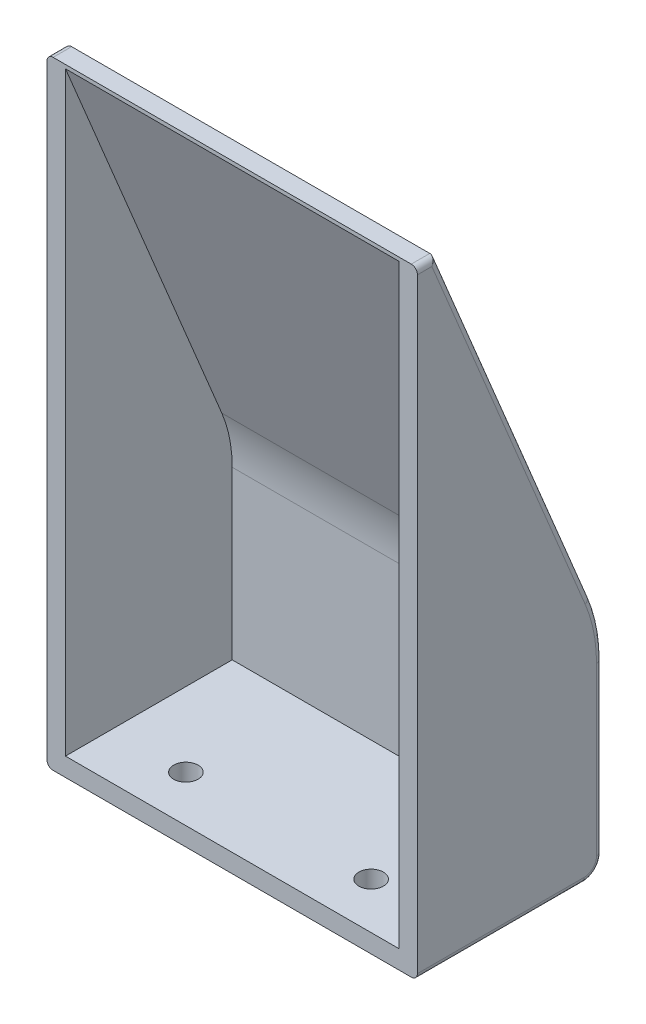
ISO-10303-21;
HEADER;
FILE_DESCRIPTION(('STEP AP214'),'2;1');
FILE_NAME('part.step','',(''),(''),'','','');
FILE_SCHEMA(('AUTOMOTIVE_DESIGN { 1 0 10303 214 1 1 1 1 }'));
ENDSEC;
DATA;
#1=APPLICATION_CONTEXT('core data for automotive mechanical design processes');
#2=APPLICATION_PROTOCOL_DEFINITION('international standard','automotive_design',2000,#1);
#3=PRODUCT_CONTEXT('',#1,'mechanical');
#4=PRODUCT('Part','Part','',(#3));
#5=PRODUCT_RELATED_PRODUCT_CATEGORY('part','',(#4));
#6=PRODUCT_DEFINITION_FORMATION('','',#4);
#7=PRODUCT_DEFINITION_CONTEXT('part definition',#1,'design');
#8=PRODUCT_DEFINITION('design','',#6,#7);
#9=PRODUCT_DEFINITION_SHAPE('','',#8);
#10=(LENGTH_UNIT() NAMED_UNIT(*) SI_UNIT(.MILLI.,.METRE.));
#11=(NAMED_UNIT(*) PLANE_ANGLE_UNIT() SI_UNIT($,.RADIAN.));
#12=(NAMED_UNIT(*) SI_UNIT($,.STERADIAN.) SOLID_ANGLE_UNIT());
#13=UNCERTAINTY_MEASURE_WITH_UNIT(LENGTH_MEASURE(1.E-05),#10,'distance_accuracy_value','');
#14=(GEOMETRIC_REPRESENTATION_CONTEXT(3) GLOBAL_UNCERTAINTY_ASSIGNED_CONTEXT((#13)) GLOBAL_UNIT_ASSIGNED_CONTEXT((#10,
#11,#12)) REPRESENTATION_CONTEXT('',''));
#15=CARTESIAN_POINT('',(0.,0.,0.));
#16=DIRECTION('',(0.,0.,1.));
#17=DIRECTION('',(1.,0.,0.));
#18=AXIS2_PLACEMENT_3D('',#15,#16,#17);
#19=CARTESIAN_POINT('',(-60.,200.,30.));
#20=DIRECTION('',(1.,0.,0.));
#21=DIRECTION('',(0.,0.,-1.));
#22=AXIS2_PLACEMENT_3D('',#19,#20,#21);
#23=PLANE('',#22);
#24=DIRECTION('',(0.,-1.,0.));
#25=VECTOR('',#24,1.);
#26=CARTESIAN_POINT('',(-60.,200.,30.));
#27=LINE('',#26,#25);
#28=CARTESIAN_POINT('',(-60.,198.,30.));
#29=VERTEX_POINT('',#28);
#30=CARTESIAN_POINT('',(-60.,2.,30.));
#31=VERTEX_POINT('',#30);
#32=EDGE_CURVE('E218',#29,#31,#27,.T.);
#33=ORIENTED_EDGE('',*,*,#32,.F.);
#34=DIRECTION('',(0.,0.,1.));
#35=VECTOR('',#34,1.);
#36=CARTESIAN_POINT('',(-60.,198.,24.));
#37=LINE('',#36,#35);
#38=CARTESIAN_POINT('',(-60.,198.,25.3349125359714));
#39=VERTEX_POINT('',#38);
#40=EDGE_CURVE('E272',#29,#39,#37,.F.);
#41=ORIENTED_EDGE('',*,*,#40,.T.);
#42=DIRECTION('',(0.,0.923496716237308,0.383606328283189));
#43=VECTOR('',#42,1.);
#44=CARTESIAN_POINT('',(-60.,201.358342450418,26.7299163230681));
#45=LINE('',#44,#43);
#46=CARTESIAN_POINT('',(-60.,78.4415159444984,-24.3278423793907));
#47=VERTEX_POINT('',#46);
#48=EDGE_CURVE('E270',#39,#47,#45,.F.);
#49=ORIENTED_EDGE('',*,*,#48,.T.);
#50=CARTESIAN_POINT('',(-60.,60.0284121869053,20.));
#51=DIRECTION('',(1.,0.,0.));
#52=DIRECTION('',(0.,0.,-1.));
#53=AXIS2_PLACEMENT_3D('',#50,#51,#52);
#54=CIRCLE('',#53,48.);
#55=CARTESIAN_POINT('',(-60.,60.0284121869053,-28.));
#56=VERTEX_POINT('',#55);
#57=EDGE_CURVE('E268',#47,#56,#54,.F.);
#58=ORIENTED_EDGE('',*,*,#57,.T.);
#59=DIRECTION('',(0.,-1.,0.));
#60=VECTOR('',#59,1.);
#61=CARTESIAN_POINT('',(-60.,200.,-28.));
#62=LINE('',#61,#60);
#63=CARTESIAN_POINT('',(-60.,6.00000000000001,-28.));
#64=VERTEX_POINT('',#63);
#65=EDGE_CURVE('E266',#56,#64,#62,.T.);
#66=ORIENTED_EDGE('',*,*,#65,.T.);
#67=CARTESIAN_POINT('',(-60.,6.00000000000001,-24.));
#68=DIRECTION('',(1.,0.,0.));
#69=DIRECTION('',(0.,0.,-1.));
#70=AXIS2_PLACEMENT_3D('',#67,#68,#69);
#71=CIRCLE('',#70,4.);
#72=CARTESIAN_POINT('',(-60.,2.,-24.));
#73=VERTEX_POINT('',#72);
#74=EDGE_CURVE('E264',#64,#73,#71,.F.);
#75=ORIENTED_EDGE('',*,*,#74,.T.);
#76=DIRECTION('',(0.,0.,1.));
#77=VECTOR('',#76,1.);
#78=CARTESIAN_POINT('',(-60.,2.,30.));
#79=LINE('',#78,#77);
#80=EDGE_CURVE('E262',#73,#31,#79,.T.);
#81=ORIENTED_EDGE('',*,*,#80,.T.);
#82=EDGE_LOOP('',(#33,#41,#49,#58,#66,#75,#81));
#83=FACE_BOUND('',#82,.T.);
#84=ADVANCED_FACE('F34',(#83),#23,.F.);
#85=CARTESIAN_POINT('',(60.,200.,30.));
#86=DIRECTION('',(0.,0.,-1.));
#87=DIRECTION('',(-1.,0.,0.));
#88=AXIS2_PLACEMENT_3D('',#85,#86,#87);
#89=PLANE('',#88);
#90=DIRECTION('',(-1.,0.,0.));
#91=VECTOR('',#90,1.);
#92=CARTESIAN_POINT('',(60.,198.803409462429,30.));
#93=LINE('',#92,#91);
#94=CARTESIAN_POINT('',(54.,198.803409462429,30.));
#95=VERTEX_POINT('',#94);
#96=CARTESIAN_POINT('',(-54.,198.803409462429,30.));
#97=VERTEX_POINT('',#96);
#98=EDGE_CURVE('E175',#95,#97,#93,.T.);
#99=ORIENTED_EDGE('',*,*,#98,.F.);
#100=DIRECTION('',(0.,-1.,0.));
#101=VECTOR('',#100,1.);
#102=CARTESIAN_POINT('',(54.,200.,30.));
#103=LINE('',#102,#101);
#104=CARTESIAN_POINT('',(54.,6.,30.));
#105=VERTEX_POINT('',#104);
#106=EDGE_CURVE('E193',#95,#105,#103,.T.);
#107=ORIENTED_EDGE('',*,*,#106,.T.);
#108=DIRECTION('',(1.,0.,0.));
#109=VECTOR('',#108,1.);
#110=CARTESIAN_POINT('',(60.,6.00000000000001,30.));
#111=LINE('',#110,#109);
#112=CARTESIAN_POINT('',(-54.,6.,30.));
#113=VERTEX_POINT('',#112);
#114=EDGE_CURVE('E198',#113,#105,#111,.T.);
#115=ORIENTED_EDGE('',*,*,#114,.F.);
#116=DIRECTION('',(0.,-1.,0.));
#117=VECTOR('',#116,1.);
#118=CARTESIAN_POINT('',(-54.,200.,30.));
#119=LINE('',#118,#117);
#120=EDGE_CURVE('E51',#97,#113,#119,.T.);
#121=ORIENTED_EDGE('',*,*,#120,.F.);
#122=EDGE_LOOP('',(#99,#107,#115,#121));
#123=FACE_BOUND('',#122,.T.);
#124=DIRECTION('',(0.,-1.,0.));
#125=VECTOR('',#124,1.);
#126=CARTESIAN_POINT('',(60.,200.,30.));
#127=LINE('',#126,#125);
#128=CARTESIAN_POINT('',(60.,198.,30.));
#129=VERTEX_POINT('',#128);
#130=CARTESIAN_POINT('',(60.,2.,30.));
#131=VERTEX_POINT('',#130);
#132=EDGE_CURVE('E214',#129,#131,#127,.T.);
#133=ORIENTED_EDGE('',*,*,#132,.F.);
#134=CARTESIAN_POINT('',(58.,198.,30.));
#135=DIRECTION('',(0.,0.,-1.));
#136=DIRECTION('',(-1.,0.,0.));
#137=AXIS2_PLACEMENT_3D('',#134,#135,#136);
#138=CIRCLE('',#137,2.);
#139=CARTESIAN_POINT('',(58.,200.,30.));
#140=VERTEX_POINT('',#139);
#141=EDGE_CURVE('E284',#129,#140,#138,.F.);
#142=ORIENTED_EDGE('',*,*,#141,.T.);
#143=DIRECTION('',(1.,0.,0.));
#144=VECTOR('',#143,1.);
#145=CARTESIAN_POINT('',(60.,200.,30.));
#146=LINE('',#145,#144);
#147=CARTESIAN_POINT('',(-58.,200.,30.));
#148=VERTEX_POINT('',#147);
#149=EDGE_CURVE('E211',#148,#140,#146,.T.);
#150=ORIENTED_EDGE('',*,*,#149,.F.);
#151=CARTESIAN_POINT('',(-58.,198.,30.));
#152=DIRECTION('',(0.,0.,-1.));
#153=DIRECTION('',(-1.,0.,0.));
#154=AXIS2_PLACEMENT_3D('',#151,#152,#153);
#155=CIRCLE('',#154,2.);
#156=EDGE_CURVE('E282',#148,#29,#155,.F.);
#157=ORIENTED_EDGE('',*,*,#156,.T.);
#158=ORIENTED_EDGE('',*,*,#32,.T.);
#159=CARTESIAN_POINT('',(-58.,2.,30.));
#160=DIRECTION('',(0.,0.,-1.));
#161=DIRECTION('',(-1.,0.,0.));
#162=AXIS2_PLACEMENT_3D('',#159,#160,#161);
#163=CIRCLE('',#162,2.);
#164=CARTESIAN_POINT('',(-58.,0.,30.));
#165=VERTEX_POINT('',#164);
#166=EDGE_CURVE('E278',#31,#165,#163,.F.);
#167=ORIENTED_EDGE('',*,*,#166,.T.);
#168=DIRECTION('',(1.,0.,0.));
#169=VECTOR('',#168,1.);
#170=CARTESIAN_POINT('',(60.,0.,30.));
#171=LINE('',#170,#169);
#172=CARTESIAN_POINT('',(58.,0.,30.));
#173=VERTEX_POINT('',#172);
#174=EDGE_CURVE('E209',#165,#173,#171,.T.);
#175=ORIENTED_EDGE('',*,*,#174,.T.);
#176=CARTESIAN_POINT('',(58.,2.,30.));
#177=DIRECTION('',(0.,0.,-1.));
#178=DIRECTION('',(-1.,0.,0.));
#179=AXIS2_PLACEMENT_3D('',#176,#177,#178);
#180=CIRCLE('',#179,2.);
#181=EDGE_CURVE('E280',#173,#131,#180,.F.);
#182=ORIENTED_EDGE('',*,*,#181,.T.);
#183=EDGE_LOOP('',(#133,#142,#150,#157,#158,#167,#175,#182));
#184=FACE_BOUND('',#183,.T.);
#185=ADVANCED_FACE('F327',(#123,#184),#89,.F.);
#186=CARTESIAN_POINT('',(60.,200.,30.));
#187=DIRECTION('',(-1.,0.,0.));
#188=DIRECTION('',(0.,0.,1.));
#189=AXIS2_PLACEMENT_3D('',#186,#187,#188);
#190=PLANE('',#189);
#191=DIRECTION('',(0.,0.923496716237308,0.383606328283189));
#192=VECTOR('',#191,1.);
#193=CARTESIAN_POINT('',(60.,201.358342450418,26.7299163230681));
#194=LINE('',#193,#192);
#195=CARTESIAN_POINT('',(60.,78.4415159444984,-24.3278423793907));
#196=VERTEX_POINT('',#195);
#197=CARTESIAN_POINT('',(60.,198.,25.3349125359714));
#198=VERTEX_POINT('',#197);
#199=EDGE_CURVE('E240',#196,#198,#194,.T.);
#200=ORIENTED_EDGE('',*,*,#199,.T.);
#201=DIRECTION('',(0.,0.,-1.));
#202=VECTOR('',#201,1.);
#203=CARTESIAN_POINT('',(60.,198.,30.));
#204=LINE('',#203,#202);
#205=EDGE_CURVE('E243',#198,#129,#204,.F.);
#206=ORIENTED_EDGE('',*,*,#205,.T.);
#207=ORIENTED_EDGE('',*,*,#132,.T.);
#208=DIRECTION('',(0.,0.,-1.));
#209=VECTOR('',#208,1.);
#210=CARTESIAN_POINT('',(60.,2.,30.));
#211=LINE('',#210,#209);
#212=CARTESIAN_POINT('',(60.,2.,-24.));
#213=VERTEX_POINT('',#212);
#214=EDGE_CURVE('E232',#131,#213,#211,.T.);
#215=ORIENTED_EDGE('',*,*,#214,.T.);
#216=CARTESIAN_POINT('',(60.,6.00000000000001,-24.));
#217=DIRECTION('',(-1.,0.,0.));
#218=DIRECTION('',(0.,0.,1.));
#219=AXIS2_PLACEMENT_3D('',#216,#217,#218);
#220=CIRCLE('',#219,4.);
#221=CARTESIAN_POINT('',(60.,6.00000000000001,-28.));
#222=VERTEX_POINT('',#221);
#223=EDGE_CURVE('E234',#213,#222,#220,.F.);
#224=ORIENTED_EDGE('',*,*,#223,.T.);
#225=DIRECTION('',(0.,-1.,0.));
#226=VECTOR('',#225,1.);
#227=CARTESIAN_POINT('',(60.,200.,-28.));
#228=LINE('',#227,#226);
#229=CARTESIAN_POINT('',(60.,60.0284121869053,-28.));
#230=VERTEX_POINT('',#229);
#231=EDGE_CURVE('E236',#222,#230,#228,.F.);
#232=ORIENTED_EDGE('',*,*,#231,.T.);
#233=CARTESIAN_POINT('',(60.,60.0284121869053,20.));
#234=DIRECTION('',(-1.,0.,0.));
#235=DIRECTION('',(0.,0.,1.));
#236=AXIS2_PLACEMENT_3D('',#233,#234,#235);
#237=CIRCLE('',#236,48.);
#238=EDGE_CURVE('E238',#230,#196,#237,.F.);
#239=ORIENTED_EDGE('',*,*,#238,.T.);
#240=EDGE_LOOP('',(#200,#206,#207,#215,#224,#232,#239));
#241=FACE_BOUND('',#240,.T.);
#242=ADVANCED_FACE('F366',(#241),#190,.F.);
#243=CARTESIAN_POINT('',(60.,200.,-30.));
#244=DIRECTION('',(0.,0.,1.));
#245=DIRECTION('',(1.,0.,0.));
#246=AXIS2_PLACEMENT_3D('',#243,#244,#245);
#247=PLANE('',#246);
#248=DIRECTION('',(-1.,0.,0.));
#249=VECTOR('',#248,1.);
#250=CARTESIAN_POINT('',(60.,60.0284121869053,-30.));
#251=LINE('',#250,#249);
#252=CARTESIAN_POINT('',(-58.,60.0284121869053,-30.));
#253=VERTEX_POINT('',#252);
#254=CARTESIAN_POINT('',(58.,60.0284121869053,-30.));
#255=VERTEX_POINT('',#254);
#256=EDGE_CURVE('E224',#253,#255,#251,.F.);
#257=ORIENTED_EDGE('',*,*,#256,.T.);
#258=DIRECTION('',(0.,-1.,0.));
#259=VECTOR('',#258,1.);
#260=CARTESIAN_POINT('',(58.,200.,-30.));
#261=LINE('',#260,#259);
#262=CARTESIAN_POINT('',(58.,6.00000000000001,-30.));
#263=VERTEX_POINT('',#262);
#264=EDGE_CURVE('E256',#255,#263,#261,.T.);
#265=ORIENTED_EDGE('',*,*,#264,.T.);
#266=DIRECTION('',(-1.,0.,0.));
#267=VECTOR('',#266,1.);
#268=CARTESIAN_POINT('',(60.,6.00000000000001,-30.));
#269=LINE('',#268,#267);
#270=CARTESIAN_POINT('',(-58.,6.00000000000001,-30.));
#271=VERTEX_POINT('',#270);
#272=EDGE_CURVE('E227',#263,#271,#269,.T.);
#273=ORIENTED_EDGE('',*,*,#272,.T.);
#274=DIRECTION('',(0.,-1.,0.));
#275=VECTOR('',#274,1.);
#276=CARTESIAN_POINT('',(-58.,200.,-30.));
#277=LINE('',#276,#275);
#278=EDGE_CURVE('E254',#271,#253,#277,.F.);
#279=ORIENTED_EDGE('',*,*,#278,.T.);
#280=EDGE_LOOP('',(#257,#265,#273,#279));
#281=FACE_BOUND('',#280,.T.);
#282=ADVANCED_FACE('F347',(#281),#247,.F.);
#283=CARTESIAN_POINT('',(-60.,200.,-30.));
#284=DIRECTION('',(0.,1.,0.));
#285=DIRECTION('',(0.,0.,1.));
#286=AXIS2_PLACEMENT_3D('',#283,#284,#285);
#287=PLANE('',#286);
#288=ORIENTED_EDGE('',*,*,#149,.T.);
#289=DIRECTION('',(0.,0.,-1.));
#290=VECTOR('',#289,1.);
#291=CARTESIAN_POINT('',(58.,200.,24.));
#292=LINE('',#291,#290);
#293=CARTESIAN_POINT('',(58.,200.,24.));
#294=VERTEX_POINT('',#293);
#295=EDGE_CURVE('E276',#140,#294,#292,.T.);
#296=ORIENTED_EDGE('',*,*,#295,.T.);
#297=DIRECTION('',(-1.,0.,0.));
#298=VECTOR('',#297,1.);
#299=CARTESIAN_POINT('',(60.,200.,24.));
#300=LINE('',#299,#298);
#301=CARTESIAN_POINT('',(-58.,200.,24.));
#302=VERTEX_POINT('',#301);
#303=EDGE_CURVE('E206',#294,#302,#300,.T.);
#304=ORIENTED_EDGE('',*,*,#303,.T.);
#305=DIRECTION('',(0.,0.,1.));
#306=VECTOR('',#305,1.);
#307=CARTESIAN_POINT('',(-58.,200.,30.));
#308=LINE('',#307,#306);
#309=EDGE_CURVE('E274',#302,#148,#308,.T.);
#310=ORIENTED_EDGE('',*,*,#309,.T.);
#311=EDGE_LOOP('',(#288,#296,#304,#310));
#312=FACE_BOUND('',#311,.T.);
#313=ADVANCED_FACE('F387',(#312),#287,.T.);
#314=CARTESIAN_POINT('',(-60.,0.,-30.));
#315=DIRECTION('',(0.,1.,0.));
#316=DIRECTION('',(0.,0.,1.));
#317=AXIS2_PLACEMENT_3D('',#314,#315,#316);
#318=PLANE('',#317);
#319=CARTESIAN_POINT('',(-30.,0.,15.));
#320=DIRECTION('',(0.,1.,0.));
#321=DIRECTION('',(0.,0.,1.));
#322=AXIS2_PLACEMENT_3D('',#319,#320,#321);
#323=CIRCLE('',#322,3.96875);
#324=CARTESIAN_POINT('',(-30.,0.,18.96875));
#325=VERTEX_POINT('',#324);
#326=EDGE_CURVE('E598',#325,#325,#323,.T.);
#327=ORIENTED_EDGE('',*,*,#326,.T.);
#328=EDGE_LOOP('',(#327));
#329=FACE_BOUND('',#328,.T.);
#330=CARTESIAN_POINT('',(30.,0.,15.));
#331=DIRECTION('',(0.,1.,0.));
#332=DIRECTION('',(0.,0.,1.));
#333=AXIS2_PLACEMENT_3D('',#330,#331,#332);
#334=CIRCLE('',#333,3.96875);
#335=CARTESIAN_POINT('',(30.,0.,18.96875));
#336=VERTEX_POINT('',#335);
#337=EDGE_CURVE('E201',#336,#336,#334,.T.);
#338=ORIENTED_EDGE('',*,*,#337,.T.);
#339=EDGE_LOOP('',(#338));
#340=FACE_BOUND('',#339,.T.);
#341=DIRECTION('',(-1.,0.,0.));
#342=VECTOR('',#341,1.);
#343=CARTESIAN_POINT('',(-60.,0.,-24.));
#344=LINE('',#343,#342);
#345=CARTESIAN_POINT('',(-58.,0.,-24.));
#346=VERTEX_POINT('',#345);
#347=CARTESIAN_POINT('',(58.,0.,-24.));
#348=VERTEX_POINT('',#347);
#349=EDGE_CURVE('E230',#346,#348,#344,.F.);
#350=ORIENTED_EDGE('',*,*,#349,.T.);
#351=DIRECTION('',(0.,0.,-1.));
#352=VECTOR('',#351,1.);
#353=CARTESIAN_POINT('',(58.,0.,-30.));
#354=LINE('',#353,#352);
#355=EDGE_CURVE('E11',#348,#173,#354,.F.);
#356=ORIENTED_EDGE('',*,*,#355,.T.);
#357=ORIENTED_EDGE('',*,*,#174,.F.);
#358=DIRECTION('',(0.,0.,1.));
#359=VECTOR('',#358,1.);
#360=CARTESIAN_POINT('',(-58.,0.,-30.));
#361=LINE('',#360,#359);
#362=EDGE_CURVE('E43',#165,#346,#361,.F.);
#363=ORIENTED_EDGE('',*,*,#362,.T.);
#364=EDGE_LOOP('',(#350,#356,#357,#363));
#365=FACE_BOUND('',#364,.T.);
#366=ADVANCED_FACE('F384',(#329,#340,#365),#318,.F.);
#367=CARTESIAN_POINT('',(60.,200.,24.));
#368=DIRECTION('',(0.,-0.383606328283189,0.923496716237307));
#369=DIRECTION('',(0.,-0.923496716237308,-0.383606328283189));
#370=AXIS2_PLACEMENT_3D('',#367,#368,#369);
#371=PLANE('',#370);
#372=ORIENTED_EDGE('',*,*,#303,.F.);
#373=DIRECTION('',(0.,0.923496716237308,0.383606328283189));
#374=VECTOR('',#373,1.);
#375=CARTESIAN_POINT('',(58.,200.,24.));
#376=LINE('',#375,#374);
#377=CARTESIAN_POINT('',(58.,79.2087286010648,-26.1748358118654));
#378=VERTEX_POINT('',#377);
#379=EDGE_CURVE('E248',#294,#378,#376,.F.);
#380=ORIENTED_EDGE('',*,*,#379,.T.);
#381=DIRECTION('',(-1.,0.,0.));
#382=VECTOR('',#381,1.);
#383=CARTESIAN_POINT('',(60.,79.2087286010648,-26.1748358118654));
#384=LINE('',#383,#382);
#385=CARTESIAN_POINT('',(-58.,79.2087286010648,-26.1748358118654));
#386=VERTEX_POINT('',#385);
#387=EDGE_CURVE('E221',#378,#386,#384,.T.);
#388=ORIENTED_EDGE('',*,*,#387,.T.);
#389=DIRECTION('',(0.,0.923496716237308,0.383606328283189));
#390=VECTOR('',#389,1.);
#391=CARTESIAN_POINT('',(-58.,200.,24.));
#392=LINE('',#391,#390);
#393=EDGE_CURVE('E245',#386,#302,#392,.T.);
#394=ORIENTED_EDGE('',*,*,#393,.T.);
#395=EDGE_LOOP('',(#372,#380,#388,#394));
#396=FACE_BOUND('',#395,.T.);
#397=ADVANCED_FACE('F386',(#396),#371,.F.);
#398=CARTESIAN_POINT('',(60.,60.0284121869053,20.));
#399=DIRECTION('',(-1.,0.,0.));
#400=DIRECTION('',(0.,-1.,0.));
#401=AXIS2_PLACEMENT_3D('',#398,#399,#400);
#402=CYLINDRICAL_SURFACE('',#401,50.);
#403=ORIENTED_EDGE('',*,*,#387,.F.);
#404=CARTESIAN_POINT('',(58.,60.0284121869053,20.));
#405=DIRECTION('',(-1.,0.,0.));
#406=DIRECTION('',(0.,0.,1.));
#407=AXIS2_PLACEMENT_3D('',#404,#405,#406);
#408=CIRCLE('',#407,50.);
#409=EDGE_CURVE('E252',#378,#255,#408,.T.);
#410=ORIENTED_EDGE('',*,*,#409,.T.);
#411=ORIENTED_EDGE('',*,*,#256,.F.);
#412=CARTESIAN_POINT('',(-58.,60.0284121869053,20.));
#413=DIRECTION('',(1.,0.,0.));
#414=DIRECTION('',(0.,0.,-1.));
#415=AXIS2_PLACEMENT_3D('',#412,#413,#414);
#416=CIRCLE('',#415,50.);
#417=EDGE_CURVE('E250',#253,#386,#416,.T.);
#418=ORIENTED_EDGE('',*,*,#417,.T.);
#419=EDGE_LOOP('',(#403,#410,#411,#418));
#420=FACE_BOUND('',#419,.T.);
#421=ADVANCED_FACE('F352',(#420),#402,.T.);
#422=CARTESIAN_POINT('',(60.,6.00000000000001,-24.));
#423=DIRECTION('',(-1.,0.,0.));
#424=DIRECTION('',(0.,0.,1.));
#425=AXIS2_PLACEMENT_3D('',#422,#423,#424);
#426=CYLINDRICAL_SURFACE('',#425,6.);
#427=ORIENTED_EDGE('',*,*,#272,.F.);
#428=CARTESIAN_POINT('',(58.,6.00000000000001,-24.));
#429=DIRECTION('',(-1.,0.,0.));
#430=DIRECTION('',(0.,0.,1.));
#431=AXIS2_PLACEMENT_3D('',#428,#429,#430);
#432=CIRCLE('',#431,6.);
#433=EDGE_CURVE('E260',#263,#348,#432,.T.);
#434=ORIENTED_EDGE('',*,*,#433,.T.);
#435=ORIENTED_EDGE('',*,*,#349,.F.);
#436=CARTESIAN_POINT('',(-58.,6.00000000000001,-24.));
#437=DIRECTION('',(1.,0.,0.));
#438=DIRECTION('',(0.,0.,-1.));
#439=AXIS2_PLACEMENT_3D('',#436,#437,#438);
#440=CIRCLE('',#439,6.);
#441=EDGE_CURVE('E258',#346,#271,#440,.T.);
#442=ORIENTED_EDGE('',*,*,#441,.T.);
#443=EDGE_LOOP('',(#427,#434,#435,#442));
#444=FACE_BOUND('',#443,.T.);
#445=ADVANCED_FACE('F374',(#444),#426,.T.);
#446=CARTESIAN_POINT('',(58.,2.,30.));
#447=DIRECTION('',(0.,0.,-1.));
#448=DIRECTION('',(-1.,0.,0.));
#449=AXIS2_PLACEMENT_3D('',#446,#447,#448);
#450=CYLINDRICAL_SURFACE('',#449,2.);
#451=ORIENTED_EDGE('',*,*,#181,.F.);
#452=ORIENTED_EDGE('',*,*,#355,.F.);
#453=CARTESIAN_POINT('',(58.,2.,-24.));
#454=DIRECTION('',(0.,0.,-1.));
#455=DIRECTION('',(-1.,0.,0.));
#456=AXIS2_PLACEMENT_3D('',#453,#454,#455);
#457=CIRCLE('',#456,2.);
#458=EDGE_CURVE('E210',#213,#348,#457,.T.);
#459=ORIENTED_EDGE('',*,*,#458,.F.);
#460=ORIENTED_EDGE('',*,*,#214,.F.);
#461=EDGE_LOOP('',(#451,#452,#459,#460));
#462=FACE_BOUND('',#461,.T.);
#463=ADVANCED_FACE('F382',(#462),#450,.T.);
#464=CARTESIAN_POINT('',(58.,6.00000000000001,-24.));
#465=DIRECTION('',(-1.,0.,0.));
#466=DIRECTION('',(0.,0.,1.));
#467=AXIS2_PLACEMENT_3D('',#464,#465,#466);
#468=TOROIDAL_SURFACE('',#467,4.,2.);
#469=ORIENTED_EDGE('',*,*,#458,.T.);
#470=ORIENTED_EDGE('',*,*,#433,.F.);
#471=CARTESIAN_POINT('',(58.,6.00000000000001,-28.));
#472=DIRECTION('',(0.,1.,0.));
#473=DIRECTION('',(0.,0.,1.));
#474=AXIS2_PLACEMENT_3D('',#471,#472,#473);
#475=CIRCLE('',#474,2.);
#476=EDGE_CURVE('E295',#222,#263,#475,.T.);
#477=ORIENTED_EDGE('',*,*,#476,.F.);
#478=ORIENTED_EDGE('',*,*,#223,.F.);
#479=EDGE_LOOP('',(#469,#470,#477,#478));
#480=FACE_BOUND('',#479,.T.);
#481=ADVANCED_FACE('F377',(#480),#468,.T.);
#482=CARTESIAN_POINT('',(58.,200.,-28.));
#483=DIRECTION('',(0.,-1.,0.));
#484=DIRECTION('',(0.,0.,-1.));
#485=AXIS2_PLACEMENT_3D('',#482,#483,#484);
#486=CYLINDRICAL_SURFACE('',#485,2.);
#487=ORIENTED_EDGE('',*,*,#476,.T.);
#488=ORIENTED_EDGE('',*,*,#264,.F.);
#489=CARTESIAN_POINT('',(58.,60.0284121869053,-28.));
#490=DIRECTION('',(0.,1.,0.));
#491=DIRECTION('',(0.,0.,1.));
#492=AXIS2_PLACEMENT_3D('',#489,#490,#491);
#493=CIRCLE('',#492,2.);
#494=EDGE_CURVE('E292',#230,#255,#493,.T.);
#495=ORIENTED_EDGE('',*,*,#494,.F.);
#496=ORIENTED_EDGE('',*,*,#231,.F.);
#497=EDGE_LOOP('',(#487,#488,#495,#496));
#498=FACE_BOUND('',#497,.T.);
#499=ADVANCED_FACE('F371',(#498),#486,.T.);
#500=CARTESIAN_POINT('',(58.,60.0284121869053,20.));
#501=DIRECTION('',(-1.,0.,0.));
#502=DIRECTION('',(0.,0.,1.));
#503=AXIS2_PLACEMENT_3D('',#500,#501,#502);
#504=TOROIDAL_SURFACE('',#503,48.,2.);
#505=ORIENTED_EDGE('',*,*,#494,.T.);
#506=ORIENTED_EDGE('',*,*,#409,.F.);
#507=CARTESIAN_POINT('',(58.,78.4415159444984,-24.3278423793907));
#508=DIRECTION('',(0.,0.923496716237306,0.383606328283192));
#509=DIRECTION('',(0.,-0.383606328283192,0.923496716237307));
#510=AXIS2_PLACEMENT_3D('',#507,#508,#509);
#511=CIRCLE('',#510,2.);
#512=EDGE_CURVE('E289',#196,#378,#511,.T.);
#513=ORIENTED_EDGE('',*,*,#512,.F.);
#514=ORIENTED_EDGE('',*,*,#238,.F.);
#515=EDGE_LOOP('',(#505,#506,#513,#514));
#516=FACE_BOUND('',#515,.T.);
#517=ADVANCED_FACE('F356',(#516),#504,.T.);
#518=CARTESIAN_POINT('',(58.,198.,-30.));
#519=DIRECTION('',(0.,0.,1.));
#520=DIRECTION('',(1.,0.,0.));
#521=AXIS2_PLACEMENT_3D('',#518,#519,#520);
#522=CYLINDRICAL_SURFACE('',#521,2.);
#523=ORIENTED_EDGE('',*,*,#141,.F.);
#524=ORIENTED_EDGE('',*,*,#205,.F.);
#525=CARTESIAN_POINT('',(58.,198.,25.3349125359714));
#526=DIRECTION('',(0.,0.555154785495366,0.831747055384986));
#527=DIRECTION('',(0.,-0.831747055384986,0.555154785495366));
#528=AXIS2_PLACEMENT_3D('',#525,#526,#527);
#529=ELLIPSE('',#528,2.40457719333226,2.);
#530=EDGE_CURVE('E287',#294,#198,#529,.F.);
#531=ORIENTED_EDGE('',*,*,#530,.F.);
#532=ORIENTED_EDGE('',*,*,#295,.F.);
#533=EDGE_LOOP('',(#523,#524,#531,#532));
#534=FACE_BOUND('',#533,.T.);
#535=ADVANCED_FACE('F416',(#534),#522,.T.);
#536=CARTESIAN_POINT('',(58.,201.358342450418,26.7299163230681));
#537=DIRECTION('',(0.,0.923496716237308,0.383606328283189));
#538=DIRECTION('',(0.,-0.383606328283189,0.923496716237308));
#539=AXIS2_PLACEMENT_3D('',#536,#537,#538);
#540=CYLINDRICAL_SURFACE('',#539,2.);
#541=ORIENTED_EDGE('',*,*,#512,.T.);
#542=ORIENTED_EDGE('',*,*,#379,.F.);
#543=ORIENTED_EDGE('',*,*,#530,.T.);
#544=ORIENTED_EDGE('',*,*,#199,.F.);
#545=EDGE_LOOP('',(#541,#542,#543,#544));
#546=FACE_BOUND('',#545,.T.);
#547=ADVANCED_FACE('F362',(#546),#540,.T.);
#548=CARTESIAN_POINT('',(-58.,2.,30.));
#549=DIRECTION('',(0.,0.,1.));
#550=DIRECTION('',(1.,0.,0.));
#551=AXIS2_PLACEMENT_3D('',#548,#549,#550);
#552=CYLINDRICAL_SURFACE('',#551,2.);
#553=ORIENTED_EDGE('',*,*,#166,.F.);
#554=ORIENTED_EDGE('',*,*,#80,.F.);
#555=CARTESIAN_POINT('',(-58.,2.,-24.));
#556=DIRECTION('',(0.,0.,-1.));
#557=DIRECTION('',(-1.,0.,0.));
#558=AXIS2_PLACEMENT_3D('',#555,#556,#557);
#559=CIRCLE('',#558,2.);
#560=EDGE_CURVE('E38',#346,#73,#559,.T.);
#561=ORIENTED_EDGE('',*,*,#560,.F.);
#562=ORIENTED_EDGE('',*,*,#362,.F.);
#563=EDGE_LOOP('',(#553,#554,#561,#562));
#564=FACE_BOUND('',#563,.T.);
#565=ADVANCED_FACE('F36',(#564),#552,.T.);
#566=CARTESIAN_POINT('',(-58.,6.00000000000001,-24.));
#567=DIRECTION('',(1.,0.,0.));
#568=DIRECTION('',(0.,0.,-1.));
#569=AXIS2_PLACEMENT_3D('',#566,#567,#568);
#570=TOROIDAL_SURFACE('',#569,4.,2.);
#571=ORIENTED_EDGE('',*,*,#560,.T.);
#572=ORIENTED_EDGE('',*,*,#74,.F.);
#573=CARTESIAN_POINT('',(-58.,6.00000000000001,-28.));
#574=DIRECTION('',(0.,1.,0.));
#575=DIRECTION('',(0.,0.,1.));
#576=AXIS2_PLACEMENT_3D('',#573,#574,#575);
#577=CIRCLE('',#576,2.);
#578=EDGE_CURVE('E306',#271,#64,#577,.T.);
#579=ORIENTED_EDGE('',*,*,#578,.F.);
#580=ORIENTED_EDGE('',*,*,#441,.F.);
#581=EDGE_LOOP('',(#571,#572,#579,#580));
#582=FACE_BOUND('',#581,.T.);
#583=ADVANCED_FACE('F317',(#582),#570,.T.);
#584=CARTESIAN_POINT('',(-58.,200.,-28.));
#585=DIRECTION('',(0.,-1.,0.));
#586=DIRECTION('',(0.,0.,-1.));
#587=AXIS2_PLACEMENT_3D('',#584,#585,#586);
#588=CYLINDRICAL_SURFACE('',#587,2.);
#589=ORIENTED_EDGE('',*,*,#578,.T.);
#590=ORIENTED_EDGE('',*,*,#65,.F.);
#591=CARTESIAN_POINT('',(-58.,60.0284121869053,-28.));
#592=DIRECTION('',(0.,1.,0.));
#593=DIRECTION('',(0.,0.,1.));
#594=AXIS2_PLACEMENT_3D('',#591,#592,#593);
#595=CIRCLE('',#594,2.);
#596=EDGE_CURVE('E304',#253,#56,#595,.T.);
#597=ORIENTED_EDGE('',*,*,#596,.F.);
#598=ORIENTED_EDGE('',*,*,#278,.F.);
#599=EDGE_LOOP('',(#589,#590,#597,#598));
#600=FACE_BOUND('',#599,.T.);
#601=ADVANCED_FACE('F344',(#600),#588,.T.);
#602=CARTESIAN_POINT('',(-58.,60.0284121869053,20.));
#603=DIRECTION('',(1.,0.,0.));
#604=DIRECTION('',(0.,0.,-1.));
#605=AXIS2_PLACEMENT_3D('',#602,#603,#604);
#606=TOROIDAL_SURFACE('',#605,48.,2.);
#607=ORIENTED_EDGE('',*,*,#596,.T.);
#608=ORIENTED_EDGE('',*,*,#57,.F.);
#609=CARTESIAN_POINT('',(-58.,78.4415159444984,-24.3278423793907));
#610=DIRECTION('',(0.,0.923496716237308,0.383606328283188));
#611=DIRECTION('',(0.,-0.383606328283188,0.923496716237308));
#612=AXIS2_PLACEMENT_3D('',#609,#610,#611);
#613=CIRCLE('',#612,2.);
#614=EDGE_CURVE('E301',#386,#47,#613,.T.);
#615=ORIENTED_EDGE('',*,*,#614,.F.);
#616=ORIENTED_EDGE('',*,*,#417,.F.);
#617=EDGE_LOOP('',(#607,#608,#615,#616));
#618=FACE_BOUND('',#617,.T.);
#619=ADVANCED_FACE('F342',(#618),#606,.T.);
#620=CARTESIAN_POINT('',(-58.,198.,-30.));
#621=DIRECTION('',(0.,0.,-1.));
#622=DIRECTION('',(-1.,0.,0.));
#623=AXIS2_PLACEMENT_3D('',#620,#621,#622);
#624=CYLINDRICAL_SURFACE('',#623,2.);
#625=ORIENTED_EDGE('',*,*,#156,.F.);
#626=ORIENTED_EDGE('',*,*,#309,.F.);
#627=CARTESIAN_POINT('',(-58.,198.,25.3349125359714));
#628=DIRECTION('',(0.,-0.555154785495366,-0.831747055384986));
#629=DIRECTION('',(0.,0.831747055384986,-0.555154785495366));
#630=AXIS2_PLACEMENT_3D('',#627,#628,#629);
#631=ELLIPSE('',#630,2.40457719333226,2.);
#632=EDGE_CURVE('E205',#39,#302,#631,.T.);
#633=ORIENTED_EDGE('',*,*,#632,.F.);
#634=ORIENTED_EDGE('',*,*,#40,.F.);
#635=EDGE_LOOP('',(#625,#626,#633,#634));
#636=FACE_BOUND('',#635,.T.);
#637=ADVANCED_FACE('F332',(#636),#624,.T.);
#638=CARTESIAN_POINT('',(-58.,199.232787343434,25.8469934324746));
#639=DIRECTION('',(0.,0.923496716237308,0.383606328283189));
#640=DIRECTION('',(0.,-0.383606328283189,0.923496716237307));
#641=AXIS2_PLACEMENT_3D('',#638,#639,#640);
#642=CYLINDRICAL_SURFACE('',#641,2.);
#643=ORIENTED_EDGE('',*,*,#614,.T.);
#644=ORIENTED_EDGE('',*,*,#48,.F.);
#645=ORIENTED_EDGE('',*,*,#632,.T.);
#646=ORIENTED_EDGE('',*,*,#393,.F.);
#647=EDGE_LOOP('',(#643,#644,#645,#646));
#648=FACE_BOUND('',#647,.T.);
#649=ADVANCED_FACE('F337',(#648),#642,.T.);
#650=CARTESIAN_POINT('',(-54.,200.,30.));
#651=DIRECTION('',(1.,0.,0.));
#652=DIRECTION('',(0.,0.,-1.));
#653=AXIS2_PLACEMENT_3D('',#650,#651,#652);
#654=PLANE('',#653);
#655=ORIENTED_EDGE('',*,*,#120,.T.);
#656=DIRECTION('',(0.,0.,1.));
#657=VECTOR('',#656,1.);
#658=CARTESIAN_POINT('',(-54.,6.00000000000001,30.));
#659=LINE('',#658,#657);
#660=CARTESIAN_POINT('',(-54.,6.,-24.));
#661=VERTEX_POINT('',#660);
#662=EDGE_CURVE('E608',#661,#113,#659,.T.);
#663=ORIENTED_EDGE('',*,*,#662,.F.);
#664=DIRECTION('',(0.,-1.,0.));
#665=VECTOR('',#664,1.);
#666=CARTESIAN_POINT('',(-54.,200.,-24.));
#667=LINE('',#666,#665);
#668=CARTESIAN_POINT('',(-54.,60.0284121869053,-24.));
#669=VERTEX_POINT('',#668);
#670=EDGE_CURVE('E181',#669,#661,#667,.T.);
#671=ORIENTED_EDGE('',*,*,#670,.F.);
#672=CARTESIAN_POINT('',(-54.,60.0284121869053,20.));
#673=DIRECTION('',(1.,0.,0.));
#674=DIRECTION('',(0.,0.,-1.));
#675=AXIS2_PLACEMENT_3D('',#672,#673,#674);
#676=CIRCLE('',#675,44.);
#677=CARTESIAN_POINT('',(-54.,76.9070906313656,-20.6338555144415));
#678=VERTEX_POINT('',#677);
#679=EDGE_CURVE('E177',#678,#669,#676,.F.);
#680=ORIENTED_EDGE('',*,*,#679,.F.);
#681=DIRECTION('',(0.,-0.923496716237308,-0.383606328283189));
#682=VECTOR('',#681,1.);
#683=CARTESIAN_POINT('',(-54.,199.823917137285,30.4239031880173));
#684=LINE('',#683,#682);
#685=EDGE_CURVE('E167',#97,#678,#684,.T.);
#686=ORIENTED_EDGE('',*,*,#685,.F.);
#687=EDGE_LOOP('',(#655,#663,#671,#680,#686));
#688=FACE_BOUND('',#687,.T.);
#689=ADVANCED_FACE('F180',(#688),#654,.T.);
#690=CARTESIAN_POINT('',(54.,200.,30.));
#691=DIRECTION('',(-1.,0.,0.));
#692=DIRECTION('',(0.,0.,1.));
#693=AXIS2_PLACEMENT_3D('',#690,#691,#692);
#694=PLANE('',#693);
#695=DIRECTION('',(0.,-0.923496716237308,-0.383606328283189));
#696=VECTOR('',#695,1.);
#697=CARTESIAN_POINT('',(54.,197.698362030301,29.5409802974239));
#698=LINE('',#697,#696);
#699=CARTESIAN_POINT('',(54.,76.9070906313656,-20.6338555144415));
#700=VERTEX_POINT('',#699);
#701=EDGE_CURVE('E615',#95,#700,#698,.T.);
#702=ORIENTED_EDGE('',*,*,#701,.T.);
#703=CARTESIAN_POINT('',(54.,60.0284121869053,20.));
#704=DIRECTION('',(-1.,0.,0.));
#705=DIRECTION('',(0.,0.,1.));
#706=AXIS2_PLACEMENT_3D('',#703,#704,#705);
#707=CIRCLE('',#706,44.);
#708=CARTESIAN_POINT('',(54.,60.0284121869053,-24.));
#709=VERTEX_POINT('',#708);
#710=EDGE_CURVE('E188',#700,#709,#707,.T.);
#711=ORIENTED_EDGE('',*,*,#710,.T.);
#712=DIRECTION('',(0.,-1.,0.));
#713=VECTOR('',#712,1.);
#714=CARTESIAN_POINT('',(54.,200.,-24.));
#715=LINE('',#714,#713);
#716=CARTESIAN_POINT('',(54.,6.,-24.));
#717=VERTEX_POINT('',#716);
#718=EDGE_CURVE('E609',#709,#717,#715,.T.);
#719=ORIENTED_EDGE('',*,*,#718,.T.);
#720=DIRECTION('',(0.,0.,1.));
#721=VECTOR('',#720,1.);
#722=CARTESIAN_POINT('',(54.,6.,-30.));
#723=LINE('',#722,#721);
#724=EDGE_CURVE('E176',#717,#105,#723,.T.);
#725=ORIENTED_EDGE('',*,*,#724,.T.);
#726=ORIENTED_EDGE('',*,*,#106,.F.);
#727=EDGE_LOOP('',(#702,#711,#719,#725,#726));
#728=FACE_BOUND('',#727,.T.);
#729=ADVANCED_FACE('F521',(#728),#694,.T.);
#730=CARTESIAN_POINT('',(60.,200.,-24.));
#731=DIRECTION('',(0.,0.,1.));
#732=DIRECTION('',(1.,0.,0.));
#733=AXIS2_PLACEMENT_3D('',#730,#731,#732);
#734=PLANE('',#733);
#735=DIRECTION('',(1.,0.,0.));
#736=VECTOR('',#735,1.);
#737=CARTESIAN_POINT('',(60.,60.0284121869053,-24.));
#738=LINE('',#737,#736);
#739=EDGE_CURVE('E189',#669,#709,#738,.T.);
#740=ORIENTED_EDGE('',*,*,#739,.F.);
#741=ORIENTED_EDGE('',*,*,#670,.T.);
#742=DIRECTION('',(1.,0.,0.));
#743=VECTOR('',#742,1.);
#744=CARTESIAN_POINT('',(-60.,6.,-24.));
#745=LINE('',#744,#743);
#746=EDGE_CURVE('E191',#661,#717,#745,.T.);
#747=ORIENTED_EDGE('',*,*,#746,.T.);
#748=ORIENTED_EDGE('',*,*,#718,.F.);
#749=EDGE_LOOP('',(#740,#741,#747,#748));
#750=FACE_BOUND('',#749,.T.);
#751=ADVANCED_FACE('F530',(#750),#734,.T.);
#752=CARTESIAN_POINT('',(-60.,6.,-30.));
#753=DIRECTION('',(0.,1.,0.));
#754=DIRECTION('',(0.,0.,1.));
#755=AXIS2_PLACEMENT_3D('',#752,#753,#754);
#756=PLANE('',#755);
#757=CARTESIAN_POINT('',(-30.,6.,15.));
#758=DIRECTION('',(0.,1.,0.));
#759=DIRECTION('',(0.,0.,1.));
#760=AXIS2_PLACEMENT_3D('',#757,#758,#759);
#761=CIRCLE('',#760,3.96875);
#762=CARTESIAN_POINT('',(-30.,6.,18.96875));
#763=VERTEX_POINT('',#762);
#764=EDGE_CURVE('E596',#763,#763,#761,.T.);
#765=ORIENTED_EDGE('',*,*,#764,.F.);
#766=EDGE_LOOP('',(#765));
#767=FACE_BOUND('',#766,.T.);
#768=CARTESIAN_POINT('',(30.,6.,15.));
#769=DIRECTION('',(0.,1.,0.));
#770=DIRECTION('',(0.,0.,1.));
#771=AXIS2_PLACEMENT_3D('',#768,#769,#770);
#772=CIRCLE('',#771,3.96875);
#773=CARTESIAN_POINT('',(30.,6.,18.96875));
#774=VERTEX_POINT('',#773);
#775=EDGE_CURVE('E599',#774,#774,#772,.T.);
#776=ORIENTED_EDGE('',*,*,#775,.F.);
#777=EDGE_LOOP('',(#776));
#778=FACE_BOUND('',#777,.T.);
#779=ORIENTED_EDGE('',*,*,#746,.F.);
#780=ORIENTED_EDGE('',*,*,#662,.T.);
#781=ORIENTED_EDGE('',*,*,#114,.T.);
#782=ORIENTED_EDGE('',*,*,#724,.F.);
#783=EDGE_LOOP('',(#779,#780,#781,#782));
#784=FACE_BOUND('',#783,.T.);
#785=ADVANCED_FACE('F540',(#767,#778,#784),#756,.T.);
#786=CARTESIAN_POINT('',(60.,197.698362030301,29.5409802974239));
#787=DIRECTION('',(0.,-0.383606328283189,0.923496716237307));
#788=DIRECTION('',(0.,-0.923496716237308,-0.383606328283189));
#789=AXIS2_PLACEMENT_3D('',#786,#787,#788);
#790=PLANE('',#789);
#791=ORIENTED_EDGE('',*,*,#98,.T.);
#792=ORIENTED_EDGE('',*,*,#685,.T.);
#793=DIRECTION('',(1.,0.,0.));
#794=VECTOR('',#793,1.);
#795=CARTESIAN_POINT('',(60.,76.9070906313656,-20.6338555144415));
#796=LINE('',#795,#794);
#797=EDGE_CURVE('E172',#700,#678,#796,.F.);
#798=ORIENTED_EDGE('',*,*,#797,.F.);
#799=ORIENTED_EDGE('',*,*,#701,.F.);
#800=EDGE_LOOP('',(#791,#792,#798,#799));
#801=FACE_BOUND('',#800,.T.);
#802=ADVANCED_FACE('F169',(#801),#790,.T.);
#803=CARTESIAN_POINT('',(60.,60.0284121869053,20.));
#804=DIRECTION('',(-1.,0.,0.));
#805=DIRECTION('',(0.,-1.,0.));
#806=AXIS2_PLACEMENT_3D('',#803,#804,#805);
#807=CYLINDRICAL_SURFACE('',#806,44.);
#808=ORIENTED_EDGE('',*,*,#797,.T.);
#809=ORIENTED_EDGE('',*,*,#679,.T.);
#810=ORIENTED_EDGE('',*,*,#739,.T.);
#811=ORIENTED_EDGE('',*,*,#710,.F.);
#812=EDGE_LOOP('',(#808,#809,#810,#811));
#813=FACE_BOUND('',#812,.T.);
#814=ADVANCED_FACE('F186',(#813),#807,.F.);
#815=CARTESIAN_POINT('',(30.,6.,15.));
#816=DIRECTION('',(0.,1.,0.));
#817=DIRECTION('',(0.,0.,1.));
#818=AXIS2_PLACEMENT_3D('',#815,#816,#817);
#819=CYLINDRICAL_SURFACE('',#818,3.96875);
#820=ORIENTED_EDGE('',*,*,#775,.T.);
#821=EDGE_LOOP('',(#820));
#822=FACE_BOUND('',#821,.T.);
#823=ORIENTED_EDGE('',*,*,#337,.F.);
#824=EDGE_LOOP('',(#823));
#825=FACE_BOUND('',#824,.T.);
#826=ADVANCED_FACE('F559',(#822,#825),#819,.F.);
#827=CARTESIAN_POINT('',(-30.,6.,15.));
#828=DIRECTION('',(0.,1.,0.));
#829=DIRECTION('',(0.,0.,1.));
#830=AXIS2_PLACEMENT_3D('',#827,#828,#829);
#831=CYLINDRICAL_SURFACE('',#830,3.96875);
#832=ORIENTED_EDGE('',*,*,#764,.T.);
#833=EDGE_LOOP('',(#832));
#834=FACE_BOUND('',#833,.T.);
#835=ORIENTED_EDGE('',*,*,#326,.F.);
#836=EDGE_LOOP('',(#835));
#837=FACE_BOUND('',#836,.T.);
#838=ADVANCED_FACE('F579',(#834,#837),#831,.F.);
#839=CLOSED_SHELL('',(#84,#185,#242,#282,#313,#366,#397,#421,#445,#463,#481,#499,#517,#535,#547,
#565,#583,#601,#619,#637,#649,#689,#729,#751,#785,#802,#814,#826,#838));
#840=MANIFOLD_SOLID_BREP('B2',#839);
#841=ADVANCED_BREP_SHAPE_REPRESENTATION('',(#18,#840),#14);
#842=SHAPE_DEFINITION_REPRESENTATION(#9,#841);
ENDSEC;
END-ISO-10303-21;
